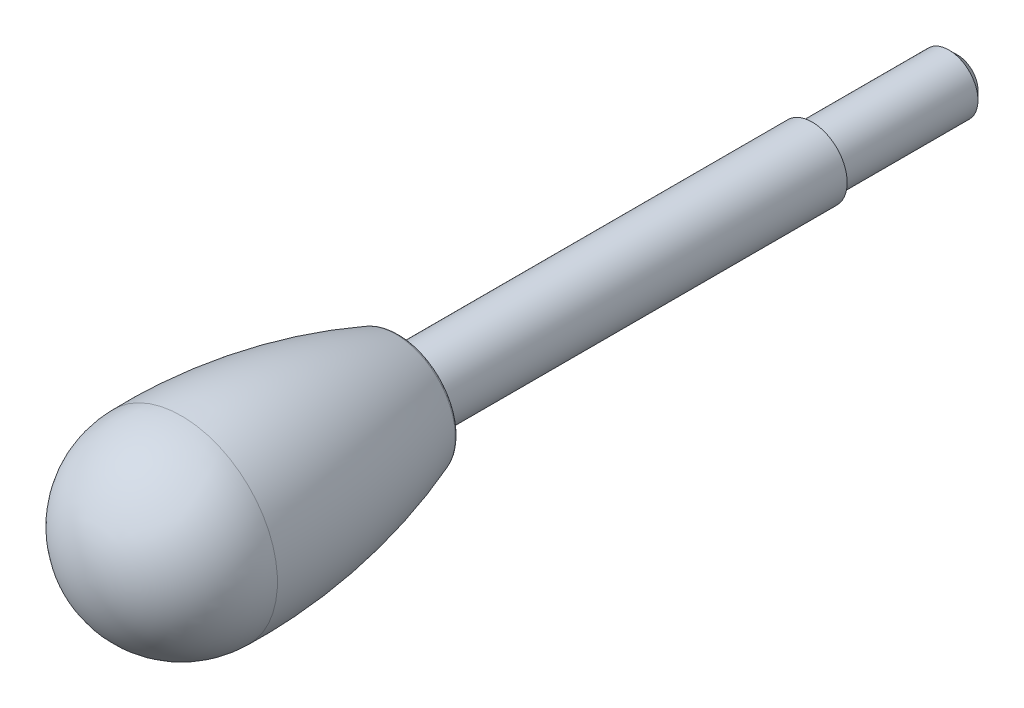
ISO-10303-21;
HEADER;
FILE_DESCRIPTION(('STEP AP214'),'2;1');
FILE_NAME('part.step','',(''),(''),'','','');
FILE_SCHEMA(('AUTOMOTIVE_DESIGN { 1 0 10303 214 1 1 1 1 }'));
ENDSEC;
DATA;
#1=APPLICATION_CONTEXT('core data for automotive mechanical design processes');
#2=APPLICATION_PROTOCOL_DEFINITION('international standard','automotive_design',2000,#1);
#3=PRODUCT_CONTEXT('',#1,'mechanical');
#4=PRODUCT('Part','Part','',(#3));
#5=PRODUCT_RELATED_PRODUCT_CATEGORY('part','',(#4));
#6=PRODUCT_DEFINITION_FORMATION('','',#4);
#7=PRODUCT_DEFINITION_CONTEXT('part definition',#1,'design');
#8=PRODUCT_DEFINITION('design','',#6,#7);
#9=PRODUCT_DEFINITION_SHAPE('','',#8);
#10=(LENGTH_UNIT() NAMED_UNIT(*) SI_UNIT(.MILLI.,.METRE.));
#11=(NAMED_UNIT(*) PLANE_ANGLE_UNIT() SI_UNIT($,.RADIAN.));
#12=(NAMED_UNIT(*) SI_UNIT($,.STERADIAN.) SOLID_ANGLE_UNIT());
#13=UNCERTAINTY_MEASURE_WITH_UNIT(LENGTH_MEASURE(1.E-05),#10,'distance_accuracy_value','');
#14=(GEOMETRIC_REPRESENTATION_CONTEXT(3) GLOBAL_UNCERTAINTY_ASSIGNED_CONTEXT((#13)) GLOBAL_UNIT_ASSIGNED_CONTEXT((#10,
#11,#12)) REPRESENTATION_CONTEXT('',''));
#15=CARTESIAN_POINT('',(0.,0.,0.));
#16=DIRECTION('',(0.,0.,1.));
#17=DIRECTION('',(1.,0.,0.));
#18=AXIS2_PLACEMENT_3D('',#15,#16,#17);
#19=CARTESIAN_POINT('',(0.,0.,108.5));
#20=DIRECTION('',(-1.,0.,0.));
#21=DIRECTION('',(0.,0.,1.));
#22=AXIS2_PLACEMENT_3D('',#19,#20,#21);
#23=SPHERICAL_SURFACE('',#22,16.5);
#24=CARTESIAN_POINT('',(0.,0.,108.5));
#25=DIRECTION('',(0.,0.,-1.));
#26=DIRECTION('',(-1.,0.,0.));
#27=AXIS2_PLACEMENT_3D('',#24,#25,#26);
#28=SPHERICAL_SURFACE('',#27,16.5);
#29=CARTESIAN_POINT('',(0.,0.,108.5));
#30=DIRECTION('',(0.,0.,-1.));
#31=DIRECTION('',(-1.,0.,0.));
#32=AXIS2_PLACEMENT_3D('',#29,#30,#31);
#33=CIRCLE('',#32,16.5);
#34=CARTESIAN_POINT('',(-16.5,0.,108.5));
#35=VERTEX_POINT('',#34);
#36=EDGE_CURVE('E8',#35,#35,#33,.T.);
#37=ORIENTED_EDGE('',*,*,#36,.F.);
#38=EDGE_LOOP('',(#37));
#39=FACE_BOUND('',#38,.T.);
#40=ADVANCED_FACE('F12',(#39),#28,.T.);
#41=CARTESIAN_POINT('',(0.,0.,106.603564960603));
#42=DIRECTION('',(0.,0.,-1.));
#43=DIRECTION('',(-1.,0.,0.));
#44=AXIS2_PLACEMENT_3D('',#41,#42,#43);
#45=DEGENERATE_TOROIDAL_SURFACE('',#44,83.9821055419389,100.5,.F.);
#46=CARTESIAN_POINT('',(0.,0.,71.652225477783));
#47=DIRECTION('',(0.,0.,-1.));
#48=DIRECTION('',(-1.,0.,0.));
#49=AXIS2_PLACEMENT_3D('',#46,#47,#48);
#50=CIRCLE('',#49,10.2445035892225);
#51=CARTESIAN_POINT('',(-10.2445035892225,0.,71.652225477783));
#52=VERTEX_POINT('',#51);
#53=EDGE_CURVE('E18',#52,#52,#50,.T.);
#54=ORIENTED_EDGE('',*,*,#53,.F.);
#55=EDGE_LOOP('',(#54));
#56=FACE_BOUND('',#55,.T.);
#57=ORIENTED_EDGE('',*,*,#36,.T.);
#58=EDGE_LOOP('',(#57));
#59=FACE_BOUND('',#58,.T.);
#60=ADVANCED_FACE('F78',(#56,#59),#45,.F.);
#61=CARTESIAN_POINT('',(0.,0.,72.));
#62=DIRECTION('',(0.,0.,-1.));
#63=DIRECTION('',(-1.,0.,0.));
#64=AXIS2_PLACEMENT_3D('',#61,#62,#63);
#65=TOROIDAL_SURFACE('',#64,9.30692538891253,0.999999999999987);
#66=CARTESIAN_POINT('',(0.,0.,71.));
#67=DIRECTION('',(0.,0.,-1.));
#68=DIRECTION('',(-1.,0.,0.));
#69=AXIS2_PLACEMENT_3D('',#66,#67,#68);
#70=CIRCLE('',#69,9.30692538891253);
#71=CARTESIAN_POINT('',(-9.30692538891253,0.,71.));
#72=VERTEX_POINT('',#71);
#73=EDGE_CURVE('E22',#72,#72,#70,.T.);
#74=ORIENTED_EDGE('',*,*,#73,.F.);
#75=EDGE_LOOP('',(#74));
#76=FACE_BOUND('',#75,.T.);
#77=ORIENTED_EDGE('',*,*,#53,.T.);
#78=EDGE_LOOP('',(#77));
#79=FACE_BOUND('',#78,.T.);
#80=ADVANCED_FACE('F73',(#76,#79),#65,.T.);
#81=CARTESIAN_POINT('',(0.,9.30692538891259,71.));
#82=DIRECTION('',(0.,0.,1.));
#83=DIRECTION('',(1.,0.,0.));
#84=AXIS2_PLACEMENT_3D('',#81,#82,#83);
#85=PLANE('',#84);
#86=CARTESIAN_POINT('',(0.,0.,71.));
#87=DIRECTION('',(0.,0.,-1.));
#88=DIRECTION('',(-1.,0.,0.));
#89=AXIS2_PLACEMENT_3D('',#86,#87,#88);
#90=CIRCLE('',#89,6.);
#91=CARTESIAN_POINT('',(-6.,0.,71.));
#92=VERTEX_POINT('',#91);
#93=EDGE_CURVE('E26',#92,#92,#90,.T.);
#94=ORIENTED_EDGE('',*,*,#93,.F.);
#95=EDGE_LOOP('',(#94));
#96=FACE_BOUND('',#95,.T.);
#97=ORIENTED_EDGE('',*,*,#73,.T.);
#98=EDGE_LOOP('',(#97));
#99=FACE_BOUND('',#98,.T.);
#100=ADVANCED_FACE('F67',(#96,#99),#85,.F.);
#101=CARTESIAN_POINT('',(0.,0.,-37.7389679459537));
#102=DIRECTION('',(0.,0.,-1.));
#103=DIRECTION('',(-1.,0.,0.));
#104=AXIS2_PLACEMENT_3D('',#101,#102,#103);
#105=CYLINDRICAL_SURFACE('',#104,6.);
#106=CARTESIAN_POINT('',(0.,0.,0.));
#107=DIRECTION('',(0.,0.,-1.));
#108=DIRECTION('',(-1.,0.,0.));
#109=AXIS2_PLACEMENT_3D('',#106,#107,#108);
#110=CIRCLE('',#109,6.);
#111=CARTESIAN_POINT('',(-6.,0.,0.));
#112=VERTEX_POINT('',#111);
#113=EDGE_CURVE('E31',#112,#112,#110,.T.);
#114=ORIENTED_EDGE('',*,*,#113,.F.);
#115=EDGE_LOOP('',(#114));
#116=FACE_BOUND('',#115,.T.);
#117=ORIENTED_EDGE('',*,*,#93,.T.);
#118=EDGE_LOOP('',(#117));
#119=FACE_BOUND('',#118,.T.);
#120=ADVANCED_FACE('F61',(#116,#119),#105,.T.);
#121=CARTESIAN_POINT('',(0.,6.,0.));
#122=DIRECTION('',(0.,0.,1.));
#123=DIRECTION('',(1.,0.,0.));
#124=AXIS2_PLACEMENT_3D('',#121,#122,#123);
#125=PLANE('',#124);
#126=CARTESIAN_POINT('',(0.,0.,0.));
#127=DIRECTION('',(0.,0.,-1.));
#128=DIRECTION('',(-1.,0.,0.));
#129=AXIS2_PLACEMENT_3D('',#126,#127,#128);
#130=CIRCLE('',#129,5.);
#131=CARTESIAN_POINT('',(-5.,0.,0.));
#132=VERTEX_POINT('',#131);
#133=EDGE_CURVE('E34',#132,#132,#130,.T.);
#134=ORIENTED_EDGE('',*,*,#133,.F.);
#135=EDGE_LOOP('',(#134));
#136=FACE_BOUND('',#135,.T.);
#137=ORIENTED_EDGE('',*,*,#113,.T.);
#138=EDGE_LOOP('',(#137));
#139=FACE_BOUND('',#138,.T.);
#140=ADVANCED_FACE('F55',(#136,#139),#125,.F.);
#141=CARTESIAN_POINT('',(0.,0.,-37.7389679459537));
#142=DIRECTION('',(0.,0.,-1.));
#143=DIRECTION('',(-1.,0.,0.));
#144=AXIS2_PLACEMENT_3D('',#141,#142,#143);
#145=CYLINDRICAL_SURFACE('',#144,5.);
#146=CARTESIAN_POINT('',(0.,0.,-23.5));
#147=DIRECTION('',(0.,0.,-1.));
#148=DIRECTION('',(-1.,0.,0.));
#149=AXIS2_PLACEMENT_3D('',#146,#147,#148);
#150=CIRCLE('',#149,5.00000000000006);
#151=CARTESIAN_POINT('',(-5.00000000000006,0.,-23.5));
#152=VERTEX_POINT('',#151);
#153=EDGE_CURVE('E37',#152,#152,#150,.T.);
#154=ORIENTED_EDGE('',*,*,#153,.F.);
#155=EDGE_LOOP('',(#154));
#156=FACE_BOUND('',#155,.T.);
#157=ORIENTED_EDGE('',*,*,#133,.T.);
#158=EDGE_LOOP('',(#157));
#159=FACE_BOUND('',#158,.T.);
#160=ADVANCED_FACE('F49',(#156,#159),#145,.T.);
#161=CARTESIAN_POINT('',(0.,0.,-23.5));
#162=DIRECTION('',(0.,0.,1.));
#163=DIRECTION('',(1.,0.,0.));
#164=AXIS2_PLACEMENT_3D('',#161,#162,#163);
#165=CONICAL_SURFACE('',#164,5.00000000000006,0.785398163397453);
#166=CARTESIAN_POINT('',(0.,0.,-25.));
#167=DIRECTION('',(0.,0.,-1.));
#168=DIRECTION('',(-1.,0.,0.));
#169=AXIS2_PLACEMENT_3D('',#166,#167,#168);
#170=CIRCLE('',#169,3.5);
#171=CARTESIAN_POINT('',(-3.5,0.,-25.));
#172=VERTEX_POINT('',#171);
#173=EDGE_CURVE('E40',#172,#172,#170,.T.);
#174=ORIENTED_EDGE('',*,*,#173,.F.);
#175=EDGE_LOOP('',(#174));
#176=FACE_BOUND('',#175,.T.);
#177=ORIENTED_EDGE('',*,*,#153,.T.);
#178=EDGE_LOOP('',(#177));
#179=FACE_BOUND('',#178,.T.);
#180=ADVANCED_FACE('F46',(#176,#179),#165,.T.);
#181=CARTESIAN_POINT('',(0.,3.5,-25.));
#182=DIRECTION('',(0.,0.,1.));
#183=DIRECTION('',(1.,0.,0.));
#184=AXIS2_PLACEMENT_3D('',#181,#182,#183);
#185=PLANE('',#184);
#186=ORIENTED_EDGE('',*,*,#173,.T.);
#187=EDGE_LOOP('',(#186));
#188=FACE_BOUND('',#187,.T.);
#189=ADVANCED_FACE('F44',(#188),#185,.F.);
#190=CLOSED_SHELL('',(#40,#60,#80,#100,#120,#140,#160,#180,#189));
#191=MANIFOLD_SOLID_BREP('B1',#190);
#192=ADVANCED_BREP_SHAPE_REPRESENTATION('',(#18,#191),#14);
#193=SHAPE_DEFINITION_REPRESENTATION(#9,#192);
ENDSEC;
END-ISO-10303-21;
